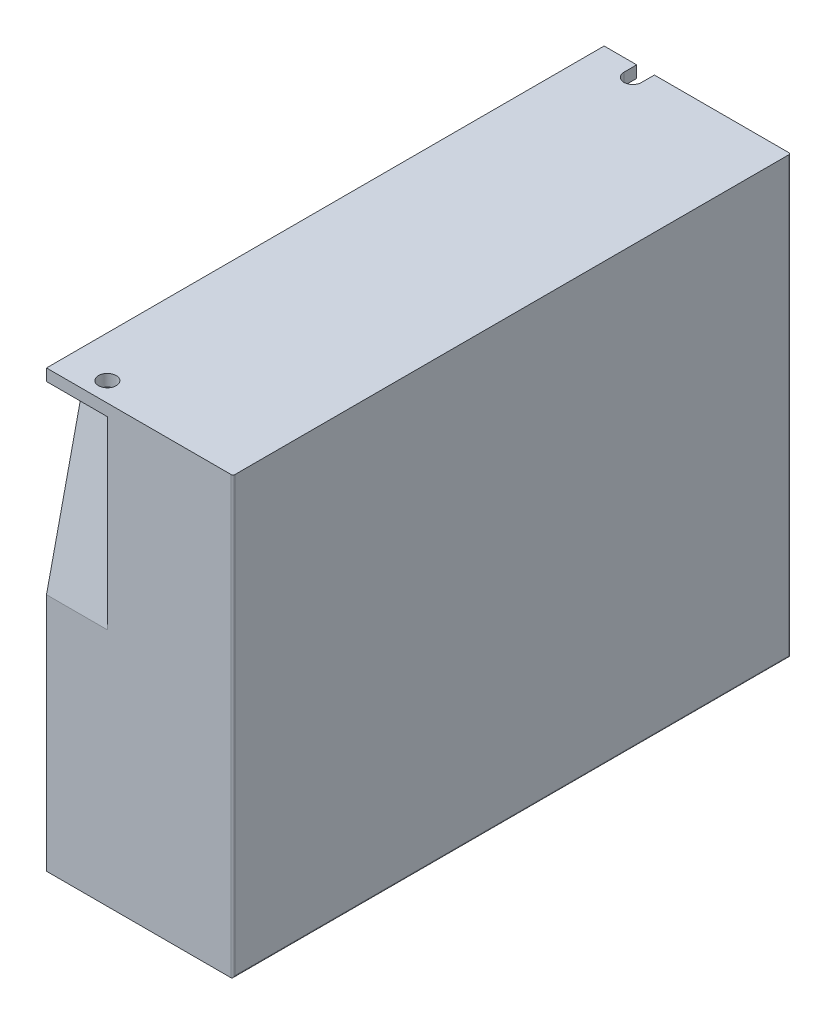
from build123d import *

# Parameters (mm, degrees)
SKETCH_1_W          = 142
SKETCH_1_H          = 111
EXTRUDE_1_DEPTH     = 47.5
CUT_EXTRUDE_1_DEPTH = 15.5
SKETCH_4_R          = 2.25
CUT_EXTRUDE_2_DEPTH = 3
FILLET_1_R          = 0.5


with BuildPart() as part:
    # Sketch 1 → Extrude 1 (new body)
    with BuildSketch(Plane(origin=(0, 0, 0), x_dir=(0, 0, -1), z_dir=(1, 0, 0))):
        Rectangle(SKETCH_1_W, SKETCH_1_H)
    extrude(amount=EXTRUDE_1_DEPTH)

    # Sketch 3 → Cut-Extrude 1 (cut)
    with BuildSketch(Plane.ZY):
        Polygon((71, 52.5), (60.5, 52.5), (71, 5.5), align=None)
        Polygon((-71, 52.5), (-71, 5.5), (-60.5, 52.5), align=None)
    extrude(amount=-CUT_EXTRUDE_1_DEPTH, mode=Mode.SUBTRACT)

    # Sketch 4 → Cut-Extrude 2 (cut)
    with BuildSketch(Plane(origin=(0, 55.5, 0), x_dir=(1, 0, 0), z_dir=(0, 1, 0))):
        with Locations(Location((10.55, -66.05, 0), (0, 0, 270))):
            Circle(SKETCH_4_R)
        with BuildLine():
            Line((8.3, 67.75), (8.3, 71))
            Line((8.3, 71), (12.8, 71))
            Line((12.8, 71), (12.8, 67.75))
            ThreePointArc((12.8, 67.75), (10.55, 65.5), (8.3, 67.75))
        make_face()
    extrude(amount=-CUT_EXTRUDE_2_DEPTH, mode=Mode.SUBTRACT)

    # Fillet 1
    fillet_1_edges = [part.edges().sort_by_distance(p)[0] for p in [
        (47.5, 0, 71),
        (47.5, -55.5, 0),
        (47.5, 0, -71),
    ]]
    fillet(fillet_1_edges, radius=FILLET_1_R)


solid = part.part
